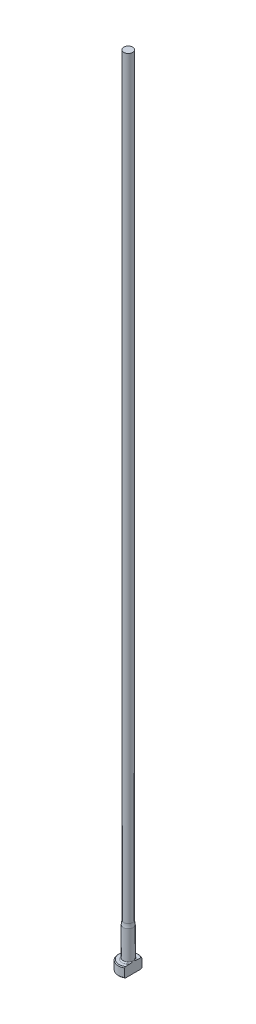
ISO-10303-21;
HEADER;
FILE_DESCRIPTION(('STEP AP214'),'2;1');
FILE_NAME('part.step','',(''),(''),'','','');
FILE_SCHEMA(('AUTOMOTIVE_DESIGN { 1 0 10303 214 1 1 1 1 }'));
ENDSEC;
DATA;
#1=APPLICATION_CONTEXT('core data for automotive mechanical design processes');
#2=APPLICATION_PROTOCOL_DEFINITION('international standard','automotive_design',2000,#1);
#3=PRODUCT_CONTEXT('',#1,'mechanical');
#4=PRODUCT('Part','Part','',(#3));
#5=PRODUCT_RELATED_PRODUCT_CATEGORY('part','',(#4));
#6=PRODUCT_DEFINITION_FORMATION('','',#4);
#7=PRODUCT_DEFINITION_CONTEXT('part definition',#1,'design');
#8=PRODUCT_DEFINITION('design','',#6,#7);
#9=PRODUCT_DEFINITION_SHAPE('','',#8);
#10=(LENGTH_UNIT() NAMED_UNIT(*) SI_UNIT(.MILLI.,.METRE.));
#11=(NAMED_UNIT(*) PLANE_ANGLE_UNIT() SI_UNIT($,.RADIAN.));
#12=(NAMED_UNIT(*) SI_UNIT($,.STERADIAN.) SOLID_ANGLE_UNIT());
#13=UNCERTAINTY_MEASURE_WITH_UNIT(LENGTH_MEASURE(1.E-05),#10,'distance_accuracy_value','');
#14=(GEOMETRIC_REPRESENTATION_CONTEXT(3) GLOBAL_UNCERTAINTY_ASSIGNED_CONTEXT((#13)) GLOBAL_UNIT_ASSIGNED_CONTEXT((#10,
#11,#12)) REPRESENTATION_CONTEXT('',''));
#15=CARTESIAN_POINT('',(0.,0.,0.));
#16=DIRECTION('',(0.,0.,1.));
#17=DIRECTION('',(1.,0.,0.));
#18=AXIS2_PLACEMENT_3D('',#15,#16,#17);
#19=CARTESIAN_POINT('',(-3.17499999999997,3.175,0.));
#20=DIRECTION('',(0.,1.,0.));
#21=DIRECTION('',(0.,0.,1.));
#22=AXIS2_PLACEMENT_3D('',#19,#20,#21);
#23=PLANE('',#22);
#24=CARTESIAN_POINT('',(0.,3.175,0.));
#25=DIRECTION('',(0.,1.,0.));
#26=DIRECTION('',(0.,0.,1.));
#27=AXIS2_PLACEMENT_3D('',#24,#25,#26);
#28=CIRCLE('',#27,2.92099999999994);
#29=CARTESIAN_POINT('',(1.58749999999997,3.175,-2.45195529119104));
#30=VERTEX_POINT('',#29);
#31=CARTESIAN_POINT('',(1.58749999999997,3.175,2.45195529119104));
#32=VERTEX_POINT('',#31);
#33=EDGE_CURVE('E105',#30,#32,#28,.T.);
#34=ORIENTED_EDGE('',*,*,#33,.T.);
#35=DIRECTION('',(0.,0.,1.));
#36=VECTOR('',#35,1.);
#37=CARTESIAN_POINT('',(1.58749999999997,3.17499999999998,2.74963065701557));
#38=LINE('',#37,#36);
#39=CARTESIAN_POINT('',(1.58749999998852,3.175,1.16397422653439));
#40=VERTEX_POINT('',#39);
#41=EDGE_CURVE('E126',#40,#32,#38,.T.);
#42=ORIENTED_EDGE('',*,*,#41,.F.);
#43=CARTESIAN_POINT('',(0.,3.175,0.));
#44=DIRECTION('',(0.,1.,0.));
#45=DIRECTION('',(0.,0.,1.));
#46=AXIS2_PLACEMENT_3D('',#43,#44,#45);
#47=CIRCLE('',#46,1.96849999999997);
#48=CARTESIAN_POINT('',(1.58749999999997,3.175,-1.16397422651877));
#49=VERTEX_POINT('',#48);
#50=EDGE_CURVE('E11',#40,#49,#47,.F.);
#51=ORIENTED_EDGE('',*,*,#50,.T.);
#52=EDGE_CURVE('E52',#30,#49,#38,.T.);
#53=ORIENTED_EDGE('',*,*,#52,.F.);
#54=EDGE_LOOP('',(#34,#42,#51,#53));
#55=FACE_BOUND('',#54,.T.);
#56=ADVANCED_FACE('F32',(#55),#23,.T.);
#57=CARTESIAN_POINT('',(0.,259.958771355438,0.));
#58=DIRECTION('',(0.,1.,0.));
#59=DIRECTION('',(0.,0.,1.));
#60=AXIS2_PLACEMENT_3D('',#57,#58,#59);
#61=CYLINDRICAL_SURFACE('',#60,3.17499999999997);
#62=CARTESIAN_POINT('',(0.,2.92100000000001,0.));
#63=DIRECTION('',(0.,1.,0.));
#64=DIRECTION('',(0.,0.,1.));
#65=AXIS2_PLACEMENT_3D('',#62,#63,#64);
#66=CIRCLE('',#65,3.17499999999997);
#67=CARTESIAN_POINT('',(1.58749999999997,2.92100000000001,2.74963065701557));
#68=VERTEX_POINT('',#67);
#69=CARTESIAN_POINT('',(1.58749999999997,2.92100000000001,-2.74963065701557));
#70=VERTEX_POINT('',#69);
#71=EDGE_CURVE('E98',#68,#70,#66,.F.);
#72=ORIENTED_EDGE('',*,*,#71,.T.);
#73=DIRECTION('',(0.,-1.,0.));
#74=VECTOR('',#73,1.);
#75=CARTESIAN_POINT('',(1.58749999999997,254.001,-2.74963065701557));
#76=LINE('',#75,#74);
#77=CARTESIAN_POINT('',(1.58749999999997,0.253999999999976,-2.74963065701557));
#78=VERTEX_POINT('',#77);
#79=EDGE_CURVE('E141',#70,#78,#76,.T.);
#80=ORIENTED_EDGE('',*,*,#79,.T.);
#81=CARTESIAN_POINT('',(0.,0.253999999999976,0.));
#82=DIRECTION('',(0.,-1.,0.));
#83=DIRECTION('',(0.,0.,-1.));
#84=AXIS2_PLACEMENT_3D('',#81,#82,#83);
#85=CIRCLE('',#84,3.17499999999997);
#86=CARTESIAN_POINT('',(1.58749999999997,0.253999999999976,2.74963065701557));
#87=VERTEX_POINT('',#86);
#88=EDGE_CURVE('E95',#78,#87,#85,.F.);
#89=ORIENTED_EDGE('',*,*,#88,.T.);
#90=DIRECTION('',(0.,-1.,0.));
#91=VECTOR('',#90,1.);
#92=CARTESIAN_POINT('',(1.58749999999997,254.001,2.74963065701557));
#93=LINE('',#92,#91);
#94=EDGE_CURVE('E88',#68,#87,#93,.T.);
#95=ORIENTED_EDGE('',*,*,#94,.F.);
#96=EDGE_LOOP('',(#72,#80,#89,#95));
#97=FACE_BOUND('',#96,.T.);
#98=ADVANCED_FACE('F191',(#97),#61,.T.);
#99=CARTESIAN_POINT('',(0.,0.,0.));
#100=DIRECTION('',(0.,-1.,0.));
#101=DIRECTION('',(0.,0.,-1.));
#102=AXIS2_PLACEMENT_3D('',#99,#100,#101);
#103=PLANE('',#102);
#104=CARTESIAN_POINT('',(0.,0.,0.));
#105=DIRECTION('',(0.,-1.,0.));
#106=DIRECTION('',(0.,0.,-1.));
#107=AXIS2_PLACEMENT_3D('',#104,#105,#106);
#108=CIRCLE('',#107,2.92100000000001);
#109=CARTESIAN_POINT('',(1.58749999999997,0.,2.45195529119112));
#110=VERTEX_POINT('',#109);
#111=CARTESIAN_POINT('',(1.58749999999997,0.,-2.45195529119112));
#112=VERTEX_POINT('',#111);
#113=EDGE_CURVE('E93',#110,#112,#108,.T.);
#114=ORIENTED_EDGE('',*,*,#113,.T.);
#115=DIRECTION('',(0.,0.,1.));
#116=VECTOR('',#115,1.);
#117=CARTESIAN_POINT('',(1.58749999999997,0.,2.74963065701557));
#118=LINE('',#117,#116);
#119=EDGE_CURVE('E78',#112,#110,#118,.T.);
#120=ORIENTED_EDGE('',*,*,#119,.T.);
#121=EDGE_LOOP('',(#114,#120));
#122=FACE_BOUND('',#121,.T.);
#123=ADVANCED_FACE('F97',(#122),#103,.T.);
#124=CARTESIAN_POINT('',(0.,3.17499999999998,0.));
#125=DIRECTION('',(0.,-1.,0.));
#126=DIRECTION('',(0.,0.,-1.));
#127=AXIS2_PLACEMENT_3D('',#124,#125,#126);
#128=CONICAL_SURFACE('',#127,2.92099999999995,0.785398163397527);
#129=ORIENTED_EDGE('',*,*,#71,.F.);
#130=CARTESIAN_POINT('',(1.58749999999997,-0.16162066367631,-6.0529050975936));
#131=CARTESIAN_POINT('',(1.58749999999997,-0.0288893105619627,-5.91567682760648));
#132=CARTESIAN_POINT('',(1.58749999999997,0.103699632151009,-5.7783103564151));
#133=CARTESIAN_POINT('',(1.58749999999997,0.368508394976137,-5.50321874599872));
#134=CARTESIAN_POINT('',(1.58749999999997,0.500728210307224,-5.36549360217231));
#135=CARTESIAN_POINT('',(1.58749999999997,0.764778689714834,-5.08953516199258));
#136=CARTESIAN_POINT('',(1.58749999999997,0.896609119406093,-4.9513016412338));
#137=CARTESIAN_POINT('',(1.58749999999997,1.15968706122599,-4.67428233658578));
#138=CARTESIAN_POINT('',(1.58749999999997,1.29093457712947,-4.53549655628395));
#139=CARTESIAN_POINT('',(1.58749999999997,1.55007705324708,-4.25997724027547));
#140=CARTESIAN_POINT('',(1.58749999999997,1.67798684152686,-4.12325766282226));
#141=CARTESIAN_POINT('',(1.58749999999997,1.9328486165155,-3.84892898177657));
#142=CARTESIAN_POINT('',(1.58749999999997,2.05980060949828,-3.71131988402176));
#143=CARTESIAN_POINT('',(1.58749999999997,2.31237508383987,-3.43493978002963));
#144=CARTESIAN_POINT('',(1.58749999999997,2.43799784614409,-3.29616903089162));
#145=CARTESIAN_POINT('',(1.58749999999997,2.68741369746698,-3.01699558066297));
#146=CARTESIAN_POINT('',(1.58749999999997,2.81120686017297,-2.8765929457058));
#147=CARTESIAN_POINT('',(1.58749999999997,3.00875865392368,-2.64816703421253));
#148=CARTESIAN_POINT('',(1.58749999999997,3.08336151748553,-2.56087478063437));
#149=CARTESIAN_POINT('',(1.58749999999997,3.2312387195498,-2.38515423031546));
#150=CARTESIAN_POINT('',(1.58749999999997,3.30451292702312,-2.29672582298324));
#151=CARTESIAN_POINT('',(1.58749999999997,3.45004422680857,-2.1174740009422));
#152=CARTESIAN_POINT('',(1.58749999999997,3.5222823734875,-2.02663514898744));
#153=CARTESIAN_POINT('',(1.58749999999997,3.66423097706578,-1.8430252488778));
#154=CARTESIAN_POINT('',(1.58749999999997,3.73394203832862,-1.75025467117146));
#155=CARTESIAN_POINT('',(1.58749999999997,3.87080633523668,-1.5606747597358));
#156=CARTESIAN_POINT('',(1.58749999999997,3.93790459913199,-1.46382547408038));
#157=CARTESIAN_POINT('',(1.58749999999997,4.06669147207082,-1.26632594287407));
#158=CARTESIAN_POINT('',(1.58749999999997,4.1283726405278,-1.16567073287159));
#159=CARTESIAN_POINT('',(1.58749999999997,4.21402252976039,-1.01165766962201));
#160=CARTESIAN_POINT('',(1.58749999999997,4.24127929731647,-0.960142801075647));
#161=CARTESIAN_POINT('',(1.58749999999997,4.2930979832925,-0.855780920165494));
#162=CARTESIAN_POINT('',(1.58749999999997,4.31765941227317,-0.802933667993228));
#163=CARTESIAN_POINT('',(1.58749999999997,4.38614656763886,-0.642461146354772));
#164=CARTESIAN_POINT('',(1.58749999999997,4.42510149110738,-0.532518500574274));
#165=CARTESIAN_POINT('',(1.58749999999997,4.46726244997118,-0.367680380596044));
#166=CARTESIAN_POINT('',(1.58749999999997,4.47844427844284,-0.314802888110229));
#167=CARTESIAN_POINT('',(1.58749999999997,4.49576654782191,-0.208209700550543));
#168=CARTESIAN_POINT('',(1.58749999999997,4.50190743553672,-0.154494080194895));
#169=CARTESIAN_POINT('',(1.58749999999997,4.50871296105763,-0.0468792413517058));
#170=CARTESIAN_POINT('',(1.58749999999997,4.5093945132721,0.00701889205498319));
#171=CARTESIAN_POINT('',(1.58749999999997,4.50527679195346,0.114606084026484));
#172=CARTESIAN_POINT('',(1.58749999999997,4.50047706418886,0.168295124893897));
#173=CARTESIAN_POINT('',(1.58749999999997,4.48579689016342,0.27448544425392));
#174=CARTESIAN_POINT('',(1.58749999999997,4.47596081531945,0.32699298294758));
#175=CARTESIAN_POINT('',(1.58749999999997,4.45181809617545,0.430974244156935));
#176=CARTESIAN_POINT('',(1.58749999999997,4.4375096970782,0.482447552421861));
#177=CARTESIAN_POINT('',(1.58749999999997,4.40502489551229,0.584460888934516));
#178=CARTESIAN_POINT('',(1.58749999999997,4.386827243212,0.634994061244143));
#179=CARTESIAN_POINT('',(1.58749999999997,4.34729308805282,0.734789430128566));
#180=CARTESIAN_POINT('',(1.58749999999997,4.3259572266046,0.784051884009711));
#181=CARTESIAN_POINT('',(1.58749999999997,4.25791922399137,0.930549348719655));
#182=CARTESIAN_POINT('',(1.58749999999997,4.20736047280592,1.0259880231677));
#183=CARTESIAN_POINT('',(1.58749999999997,4.0995545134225,1.21304313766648));
#184=CARTESIAN_POINT('',(1.58749999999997,4.04229912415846,1.30465471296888));
#185=CARTESIAN_POINT('',(1.58749999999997,3.92308746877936,1.48526211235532));
#186=CARTESIAN_POINT('',(1.58749999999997,3.86111349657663,1.57424615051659));
#187=CARTESIAN_POINT('',(1.58749999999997,3.73408621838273,1.74990003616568));
#188=CARTESIAN_POINT('',(1.58749999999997,3.66903444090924,1.83657099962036));
#189=CARTESIAN_POINT('',(1.58749999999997,3.53583371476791,2.00931764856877));
#190=CARTESIAN_POINT('',(1.58749999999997,3.46765527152,2.09537048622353));
#191=CARTESIAN_POINT('',(1.58749999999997,3.32960643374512,2.26611736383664));
#192=CARTESIAN_POINT('',(1.58749999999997,3.25973586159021,2.35081125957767));
#193=CARTESIAN_POINT('',(1.58749999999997,3.04858139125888,2.60290121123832));
#194=CARTESIAN_POINT('',(1.58749999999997,2.90542388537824,2.76872537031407));
#195=CARTESIAN_POINT('',(1.58749999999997,2.64069522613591,3.06970913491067));
#196=CARTESIAN_POINT('',(1.58749999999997,2.51959458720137,3.20528660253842));
#197=CARTESIAN_POINT('',(1.58749999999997,2.27590400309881,3.47510321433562));
#198=CARTESIAN_POINT('',(1.58749999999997,2.15331401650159,3.60934232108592));
#199=CARTESIAN_POINT('',(1.58749999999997,1.90694239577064,3.87695374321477));
#200=CARTESIAN_POINT('',(1.58749999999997,1.78315974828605,4.0103251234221));
#201=CARTESIAN_POINT('',(1.58749999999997,1.53478104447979,4.27630880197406));
#202=CARTESIAN_POINT('',(1.58749999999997,1.41018498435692,4.40892109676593));
#203=CARTESIAN_POINT('',(1.58749999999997,1.0457468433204,4.79499418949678));
#204=CARTESIAN_POINT('',(1.58749999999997,0.80507680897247,5.04767313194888));
#205=CARTESIAN_POINT('',(1.58749999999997,0.443121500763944,5.42550911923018));
#206=CARTESIAN_POINT('',(1.58749999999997,0.322378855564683,5.55118772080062));
#207=CARTESIAN_POINT('',(1.58749999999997,0.0805914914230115,5.80225207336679));
#208=CARTESIAN_POINT('',(1.58749999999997,-0.040453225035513,5.92763782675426));
#209=CARTESIAN_POINT('',(1.58749999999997,-0.161620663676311,6.0529050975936));
#210=B_SPLINE_CURVE_WITH_KNOTS('',3,(#130,#131,#132,#133,#134,#135,#136,#137,#138,#139,#140,
#141,#142,#143,#144,#145,#146,#147,#148,#149,#150,#151,#152,#153,#154,#155,#156,#157,#158,#159,
#160,#161,#162,#163,#164,#165,#166,#167,#168,#169,#170,#171,#172,#173,#174,#175,#176,#177,#178,
#179,#180,#181,#182,#183,#184,#185,#186,#187,#188,#189,#190,#191,#192,#193,#194,#195,#196,#197,
#198,#199,#200,#201,#202,#203,#204,#205,#206,#207,#208,#209),.UNSPECIFIED.,.F.,.F.,(4,2,2,2,2,2,
2,2,2,2,2,2,2,2,2,2,2,2,2,2,2,2,2,2,2,2,2,2,2,2,2,2,2,2,2,2,2,2,2,4),(0.,0.572750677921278,
1.14550874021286,1.71856057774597,2.29160869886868,2.85328006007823,3.4149477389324,
3.97649423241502,4.53801804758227,4.88249307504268,5.22700189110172,5.5751532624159,
5.92322081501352,6.27657800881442,6.63041319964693,6.80518126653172,6.9799810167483,
7.3282426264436,7.49018491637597,7.65211285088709,7.81353889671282,7.97497832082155,
8.13501929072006,8.29512313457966,8.45612518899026,8.61709438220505,8.94062993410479,
9.2645649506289,9.58978187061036,9.91483894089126,10.2441741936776,10.5735441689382,
11.2306812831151,11.7760337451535,12.3214014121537,12.8672825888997,13.4131663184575,
14.4600164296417,14.9828595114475,15.5056983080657),.UNSPECIFIED.);
#211=EDGE_CURVE('E118',#32,#68,#210,.T.);
#212=ORIENTED_EDGE('',*,*,#211,.F.);
#213=ORIENTED_EDGE('',*,*,#33,.F.);
#214=EDGE_CURVE('E117',#70,#30,#210,.T.);
#215=ORIENTED_EDGE('',*,*,#214,.F.);
#216=EDGE_LOOP('',(#129,#212,#213,#215));
#217=FACE_BOUND('',#216,.T.);
#218=ADVANCED_FACE('F162',(#217),#128,.T.);
#219=CARTESIAN_POINT('',(0.,0.253999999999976,0.));
#220=DIRECTION('',(0.,1.,0.));
#221=DIRECTION('',(0.,0.,1.));
#222=AXIS2_PLACEMENT_3D('',#219,#220,#221);
#223=CONICAL_SURFACE('',#222,3.17499999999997,0.785398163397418);
#224=ORIENTED_EDGE('',*,*,#88,.F.);
#225=CARTESIAN_POINT('',(1.58749999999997,3.33662066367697,6.0529050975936));
#226=CARTESIAN_POINT('',(1.58749999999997,3.20388931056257,5.91567682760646));
#227=CARTESIAN_POINT('',(1.58749999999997,3.07130036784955,5.77831035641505));
#228=CARTESIAN_POINT('',(1.58749999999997,2.80649160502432,5.50321874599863));
#229=CARTESIAN_POINT('',(1.58749999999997,2.67427178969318,5.3654936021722));
#230=CARTESIAN_POINT('',(1.58749999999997,2.41022131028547,5.08953516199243));
#231=CARTESIAN_POINT('',(1.58749999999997,2.27839088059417,4.95130164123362));
#232=CARTESIAN_POINT('',(1.58749999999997,2.01531293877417,4.67428233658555));
#233=CARTESIAN_POINT('',(1.58749999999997,1.88406542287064,4.5354965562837));
#234=CARTESIAN_POINT('',(1.58749999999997,1.62492294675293,4.25997724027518));
#235=CARTESIAN_POINT('',(1.58749999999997,1.49701315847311,4.12325766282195));
#236=CARTESIAN_POINT('',(1.58749999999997,1.24215138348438,3.84892898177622));
#237=CARTESIAN_POINT('',(1.58749999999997,1.11519939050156,3.71131988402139));
#238=CARTESIAN_POINT('',(1.58749999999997,0.862624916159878,3.43493978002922));
#239=CARTESIAN_POINT('',(1.58749999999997,0.737002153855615,3.29616903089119));
#240=CARTESIAN_POINT('',(1.58749999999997,0.487586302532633,3.01699558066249));
#241=CARTESIAN_POINT('',(1.58749999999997,0.363793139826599,2.8765929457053));
#242=CARTESIAN_POINT('',(1.58749999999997,0.166241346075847,2.64816703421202));
#243=CARTESIAN_POINT('',(1.58749999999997,0.0916384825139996,2.56087478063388));
#244=CARTESIAN_POINT('',(1.58749999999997,-0.0562387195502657,2.385154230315));
#245=CARTESIAN_POINT('',(1.58749999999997,-0.129512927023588,2.29672582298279));
#246=CARTESIAN_POINT('',(1.58749999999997,-0.27504422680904,2.11747400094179));
#247=CARTESIAN_POINT('',(1.58749999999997,-0.347282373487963,2.02663514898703));
#248=CARTESIAN_POINT('',(1.58749999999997,-0.489230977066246,1.84302524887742));
#249=CARTESIAN_POINT('',(1.58749999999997,-0.558942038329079,1.7502546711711));
#250=CARTESIAN_POINT('',(1.58749999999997,-0.695806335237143,1.56067475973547));
#251=CARTESIAN_POINT('',(1.58749999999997,-0.762904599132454,1.46382547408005));
#252=CARTESIAN_POINT('',(1.58749999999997,-0.891691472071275,1.26632594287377));
#253=CARTESIAN_POINT('',(1.58749999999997,-0.953372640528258,1.16567073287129));
#254=CARTESIAN_POINT('',(1.58749999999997,-1.03902252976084,1.01165766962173));
#255=CARTESIAN_POINT('',(1.58749999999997,-1.06627929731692,0.960142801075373));
#256=CARTESIAN_POINT('',(1.58749999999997,-1.11809798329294,0.85578092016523));
#257=CARTESIAN_POINT('',(1.58749999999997,-1.14265941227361,0.802933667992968));
#258=CARTESIAN_POINT('',(1.58749999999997,-1.21114656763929,0.642461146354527));
#259=CARTESIAN_POINT('',(1.58749999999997,-1.2501014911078,0.532518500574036));
#260=CARTESIAN_POINT('',(1.58749999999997,-1.29226244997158,0.367680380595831));
#261=CARTESIAN_POINT('',(1.58749999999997,-1.30344427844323,0.314802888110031));
#262=CARTESIAN_POINT('',(1.58749999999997,-1.32076654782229,0.208209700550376));
#263=CARTESIAN_POINT('',(1.58749999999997,-1.3269074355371,0.154494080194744));
#264=CARTESIAN_POINT('',(1.58749999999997,-1.333712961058,0.0468792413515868));
#265=CARTESIAN_POINT('',(1.58749999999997,-1.33439451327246,-0.00701889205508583));
#266=CARTESIAN_POINT('',(1.58749999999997,-1.33027679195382,-0.114606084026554));
#267=CARTESIAN_POINT('',(1.58749999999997,-1.32547706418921,-0.168295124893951));
#268=CARTESIAN_POINT('',(1.58749999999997,-1.31079689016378,-0.274485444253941));
#269=CARTESIAN_POINT('',(1.58749999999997,-1.3009608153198,-0.326992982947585));
#270=CARTESIAN_POINT('',(1.58749999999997,-1.27681809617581,-0.430974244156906));
#271=CARTESIAN_POINT('',(1.58749999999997,-1.26250969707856,-0.482447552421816));
#272=CARTESIAN_POINT('',(1.58749999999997,-1.23002489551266,-0.584460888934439));
#273=CARTESIAN_POINT('',(1.58749999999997,-1.21182724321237,-0.634994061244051));
#274=CARTESIAN_POINT('',(1.58749999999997,-1.1722930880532,-0.734789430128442));
#275=CARTESIAN_POINT('',(1.58749999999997,-1.15095722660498,-0.784051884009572));
#276=CARTESIAN_POINT('',(1.58749999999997,-1.08291922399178,-0.93054934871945));
#277=CARTESIAN_POINT('',(1.58749999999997,-1.03236047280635,-1.02598802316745));
#278=CARTESIAN_POINT('',(1.58749999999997,-0.924554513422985,-1.21304313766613));
#279=CARTESIAN_POINT('',(1.58749999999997,-0.86729912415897,-1.30465471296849));
#280=CARTESIAN_POINT('',(1.58749999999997,-0.748087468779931,-1.48526211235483));
#281=CARTESIAN_POINT('',(1.58749999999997,-0.686113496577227,-1.57424615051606));
#282=CARTESIAN_POINT('',(1.58749999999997,-0.55908621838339,-1.74990003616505));
#283=CARTESIAN_POINT('',(1.58749999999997,-0.494034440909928,-1.83657099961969));
#284=CARTESIAN_POINT('',(1.58749999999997,-0.360833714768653,-2.00931764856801));
#285=CARTESIAN_POINT('',(1.58749999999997,-0.292655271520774,-2.09537048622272));
#286=CARTESIAN_POINT('',(1.58749999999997,-0.154606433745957,-2.26611736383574));
#287=CARTESIAN_POINT('',(1.58749999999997,-0.0847358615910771,-2.35081125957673));
#288=CARTESIAN_POINT('',(1.58749999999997,0.126418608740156,-2.60290121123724));
#289=CARTESIAN_POINT('',(1.58749999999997,0.269576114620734,-2.76872537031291));
#290=CARTESIAN_POINT('',(1.58749999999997,0.534304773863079,-3.06970913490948));
#291=CARTESIAN_POINT('',(1.58749999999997,0.655405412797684,-3.20528660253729));
#292=CARTESIAN_POINT('',(1.58749999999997,0.899095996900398,-3.47510321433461));
#293=CARTESIAN_POINT('',(1.58749999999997,1.02168598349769,-3.60934232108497));
#294=CARTESIAN_POINT('',(1.58749999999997,1.26805760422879,-3.87695374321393));
#295=CARTESIAN_POINT('',(1.58749999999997,1.39184025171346,-4.01032512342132));
#296=CARTESIAN_POINT('',(1.58749999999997,1.64021895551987,-4.2763088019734));
#297=CARTESIAN_POINT('',(1.58749999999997,1.76481501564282,-4.40892109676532));
#298=CARTESIAN_POINT('',(1.58749999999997,2.12925315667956,-4.79499418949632));
#299=CARTESIAN_POINT('',(1.58749999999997,2.36992319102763,-5.04767313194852));
#300=CARTESIAN_POINT('',(1.58749999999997,2.73187849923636,-5.42550911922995));
#301=CARTESIAN_POINT('',(1.58749999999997,2.85262114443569,-5.55118772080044));
#302=CARTESIAN_POINT('',(1.58749999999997,3.09440850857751,-5.8022520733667));
#303=CARTESIAN_POINT('',(1.58749999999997,3.2154532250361,-5.92763782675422));
#304=CARTESIAN_POINT('',(1.58749999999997,3.33662066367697,-6.0529050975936));
#305=B_SPLINE_CURVE_WITH_KNOTS('',3,(#225,#226,#227,#228,#229,#230,#231,#232,#233,#234,#235,
#236,#237,#238,#239,#240,#241,#242,#243,#244,#245,#246,#247,#248,#249,#250,#251,#252,#253,#254,
#255,#256,#257,#258,#259,#260,#261,#262,#263,#264,#265,#266,#267,#268,#269,#270,#271,#272,#273,
#274,#275,#276,#277,#278,#279,#280,#281,#282,#283,#284,#285,#286,#287,#288,#289,#290,#291,#292,
#293,#294,#295,#296,#297,#298,#299,#300,#301,#302,#303,#304),.UNSPECIFIED.,.F.,.F.,(4,2,2,2,2,2,
2,2,2,2,2,2,2,2,2,2,2,2,2,2,2,2,2,2,2,2,2,2,2,2,2,2,2,2,2,2,2,2,2,4),(0.,0.57275067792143,
1.14550874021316,1.71856057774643,2.29160869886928,2.85328006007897,3.41494773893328,
3.97649423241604,4.53801804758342,4.88249307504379,5.2270018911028,5.57515326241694,
5.92322081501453,6.27657800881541,6.63041319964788,6.80518126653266,6.97998101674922,
7.32824262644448,7.49018491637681,7.65211285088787,7.81353889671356,7.97497832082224,
8.1350192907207,8.29512313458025,8.45612518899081,8.61709438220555,8.94062993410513,
9.26456495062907,9.58978187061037,9.91483894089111,10.2441741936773,10.5735441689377,
11.2306812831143,11.776033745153,12.3214014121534,12.8672825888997,13.4131663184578,
14.4600164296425,14.9828595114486,15.505698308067),.UNSPECIFIED.);
#306=EDGE_CURVE('E81',#112,#78,#305,.T.);
#307=ORIENTED_EDGE('',*,*,#306,.F.);
#308=ORIENTED_EDGE('',*,*,#113,.F.);
#309=EDGE_CURVE('E84',#87,#110,#305,.T.);
#310=ORIENTED_EDGE('',*,*,#309,.F.);
#311=EDGE_LOOP('',(#224,#307,#308,#310));
#312=FACE_BOUND('',#311,.T.);
#313=ADVANCED_FACE('F92',(#312),#223,.T.);
#314=CARTESIAN_POINT('',(0.,3.556,0.));
#315=DIRECTION('',(0.,1.,0.));
#316=DIRECTION('',(0.,0.,1.));
#317=AXIS2_PLACEMENT_3D('',#314,#315,#316);
#318=TOROIDAL_SURFACE('',#317,1.96849999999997,0.381);
#319=CARTESIAN_POINT('',(1.58749999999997,3.556,0.));
#320=CARTESIAN_POINT('',(1.58749999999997,3.55599928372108,-9.72839998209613E-12));
#321=CARTESIAN_POINT('',(1.58749999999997,3.55599856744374,-1.16390048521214E-07));
#322=CARTESIAN_POINT('',(1.58749999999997,3.55599717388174,-5.02802253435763E-07));
#323=CARTESIAN_POINT('',(1.58749999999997,3.55599649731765,-7.75049116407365E-07));
#324=CARTESIAN_POINT('',(1.58749999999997,3.55599515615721,-1.43578185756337E-06));
#325=CARTESIAN_POINT('',(1.58749999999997,3.55599449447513,-1.83004116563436E-06));
#326=CARTESIAN_POINT('',(1.58749999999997,3.55599322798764,-2.69326525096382E-06));
#327=CARTESIAN_POINT('',(1.58749999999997,3.55599262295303,-3.16190628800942E-06));
#328=CARTESIAN_POINT('',(1.58749999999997,3.55599066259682,-4.80183833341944E-06));
#329=CARTESIAN_POINT('',(1.58749999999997,3.55598938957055,-6.07237548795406E-06));
#330=CARTESIAN_POINT('',(1.58749999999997,3.55598706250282,-8.74131694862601E-06));
#331=CARTESIAN_POINT('',(1.58749999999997,3.55598600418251,-1.01362054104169E-05));
#332=CARTESIAN_POINT('',(1.58749999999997,3.55598220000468,-1.54025644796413E-05));
#333=CARTESIAN_POINT('',(1.58749999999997,3.55597966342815,-1.94297992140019E-05));
#334=CARTESIAN_POINT('',(1.58749999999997,3.55597535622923,-2.75116574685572E-05));
#335=CARTESIAN_POINT('',(1.58749999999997,3.55597354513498,-3.15456374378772E-05));
#336=CARTESIAN_POINT('',(1.58749999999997,3.55596616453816,-4.82039076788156E-05));
#337=CARTESIAN_POINT('',(1.58749999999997,3.55596077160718,-6.08993138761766E-05));
#338=CARTESIAN_POINT('',(1.58749999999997,3.55595181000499,-8.49758225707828E-05));
#339=CARTESIAN_POINT('',(1.58749999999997,3.55594809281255,-9.6299831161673E-05));
#340=CARTESIAN_POINT('',(1.58749999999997,3.55591954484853,-0.000176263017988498));
#341=CARTESIAN_POINT('',(1.58749999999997,3.55588430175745,-0.000240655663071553));
#342=CARTESIAN_POINT('',(1.58749999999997,3.55575419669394,-0.000487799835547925));
#343=CARTESIAN_POINT('',(1.58749999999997,3.55566706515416,-0.000673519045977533));
#344=CARTESIAN_POINT('',(1.58749999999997,3.55532896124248,-0.00138308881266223));
#345=CARTESIAN_POINT('',(1.58749999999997,3.55506990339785,-0.0019038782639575));
#346=CARTESIAN_POINT('',(1.58749999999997,3.55403272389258,-0.00399959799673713));
#347=CARTESIAN_POINT('',(1.58749999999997,3.55326363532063,-0.0055779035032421));
#348=CARTESIAN_POINT('',(1.58749999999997,3.53734419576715,-0.0382341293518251));
#349=CARTESIAN_POINT('',(1.58749999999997,3.52209124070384,-0.0692744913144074));
#350=CARTESIAN_POINT('',(1.58749999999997,3.49234031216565,-0.130397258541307));
#351=CARTESIAN_POINT('',(1.58749999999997,3.4778343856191,-0.160476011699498));
#352=CARTESIAN_POINT('',(1.58749999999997,3.44756579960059,-0.22405302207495));
#353=CARTESIAN_POINT('',(1.58749999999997,3.43183768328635,-0.257567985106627));
#354=CARTESIAN_POINT('',(1.58749999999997,3.40084315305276,-0.325196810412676));
#355=CARTESIAN_POINT('',(1.58749999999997,3.38558252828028,-0.359313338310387));
#356=CARTESIAN_POINT('',(1.58749999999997,3.35947844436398,-0.419670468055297));
#357=CARTESIAN_POINT('',(1.58749999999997,3.34845502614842,-0.445832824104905));
#358=CARTESIAN_POINT('',(1.58749999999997,3.32703860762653,-0.498343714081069));
#359=CARTESIAN_POINT('',(1.58749999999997,3.31664422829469,-0.52469168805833));
#360=CARTESIAN_POINT('',(1.58749999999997,3.2869407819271,-0.603098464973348));
#361=CARTESIAN_POINT('',(1.58749999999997,3.26865317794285,-0.655557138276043));
#362=CARTESIAN_POINT('',(1.58749999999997,3.24332469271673,-0.737608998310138));
#363=CARTESIAN_POINT('',(1.58749999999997,3.23494346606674,-0.766787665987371));
#364=CARTESIAN_POINT('',(1.58749999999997,3.21949479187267,-0.825628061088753));
#365=CARTESIAN_POINT('',(1.58749999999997,3.21243348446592,-0.855291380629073));
#366=CARTESIAN_POINT('',(1.58749999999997,3.19303275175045,-0.947623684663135));
#367=CARTESIAN_POINT('',(1.58749999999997,3.18336484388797,-1.01091582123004));
#368=CARTESIAN_POINT('',(1.58749999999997,3.17464826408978,-1.12491727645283));
#369=CARTESIAN_POINT('',(1.58749999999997,3.17379742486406,-1.17548103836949));
#370=CARTESIAN_POINT('',(1.58749999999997,3.17980825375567,-1.2756075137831));
#371=CARTESIAN_POINT('',(1.58749999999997,3.18656467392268,-1.32517446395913));
#372=CARTESIAN_POINT('',(1.58749999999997,3.20510062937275,-1.40268723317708));
#373=CARTESIAN_POINT('',(1.58749999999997,3.21379930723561,-1.43136704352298));
#374=CARTESIAN_POINT('',(1.58749999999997,3.23523847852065,-1.48727388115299));
#375=CARTESIAN_POINT('',(1.58749999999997,3.24798385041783,-1.51449910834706));
#376=CARTESIAN_POINT('',(1.58749999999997,3.27479889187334,-1.56082978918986));
#377=CARTESIAN_POINT('',(1.58749999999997,3.2880084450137,-1.5804296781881));
#378=CARTESIAN_POINT('',(1.58749999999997,3.31738741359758,-1.61726850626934));
#379=CARTESIAN_POINT('',(1.58749999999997,3.33355126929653,-1.63451177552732));
#380=CARTESIAN_POINT('',(1.58749999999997,3.3650209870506,-1.66235366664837));
#381=CARTESIAN_POINT('',(1.58749999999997,3.37976591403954,-1.67358404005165));
#382=CARTESIAN_POINT('',(1.58749999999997,3.41090649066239,-1.69348690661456));
#383=CARTESIAN_POINT('',(1.58749999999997,3.42730148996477,-1.70216040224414));
#384=CARTESIAN_POINT('',(1.58749999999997,3.46152587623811,-1.71647536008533));
#385=CARTESIAN_POINT('',(1.58749999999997,3.47936500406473,-1.72209384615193));
#386=CARTESIAN_POINT('',(1.58749999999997,3.51579449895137,-1.72977101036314));
#387=CARTESIAN_POINT('',(1.58749999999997,3.53438431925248,-1.73183223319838));
#388=CARTESIAN_POINT('',(1.58749999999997,3.5693049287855,-1.73220894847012));
#389=CARTESIAN_POINT('',(1.58749999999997,3.58563247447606,-1.73095378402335));
#390=CARTESIAN_POINT('',(1.58749999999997,3.61782719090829,-1.72566824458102));
#391=CARTESIAN_POINT('',(1.58749999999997,3.6336944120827,-1.72163817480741));
#392=CARTESIAN_POINT('',(1.58749999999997,3.66430913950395,-1.71112762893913));
#393=CARTESIAN_POINT('',(1.58749999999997,3.67907021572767,-1.70468621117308));
#394=CARTESIAN_POINT('',(1.58749999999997,3.7074589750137,-1.68967506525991));
#395=CARTESIAN_POINT('',(1.58749999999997,3.72108625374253,-1.68110458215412));
#396=CARTESIAN_POINT('',(1.58749999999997,3.75190835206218,-1.6586320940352));
#397=CARTESIAN_POINT('',(1.58749999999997,3.76852524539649,-1.64393589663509));
#398=CARTESIAN_POINT('',(1.58749999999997,3.79915076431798,-1.61203006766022));
#399=CARTESIAN_POINT('',(1.58749999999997,3.81315342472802,-1.59481484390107));
#400=CARTESIAN_POINT('',(1.58749999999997,3.84335302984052,-1.55180967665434));
#401=CARTESIAN_POINT('',(1.58749999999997,3.85840997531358,-1.52522183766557));
#402=CARTESIAN_POINT('',(1.58749999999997,3.8840928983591,-1.47008223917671));
#403=CARTESIAN_POINT('',(1.58749999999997,3.89472145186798,-1.44153163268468));
#404=CARTESIAN_POINT('',(1.58749999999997,3.91656912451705,-1.36850699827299));
#405=CARTESIAN_POINT('',(1.58749999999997,3.92534811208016,-1.32330828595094));
#406=CARTESIAN_POINT('',(1.58749999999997,3.93598980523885,-1.23163561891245));
#407=CARTESIAN_POINT('',(1.58749999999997,3.93776012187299,-1.18515271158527));
#408=CARTESIAN_POINT('',(1.58749999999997,3.93485724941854,-1.056626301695));
#409=CARTESIAN_POINT('',(1.58749999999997,3.9241811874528,-0.974728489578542));
#410=CARTESIAN_POINT('',(1.58749999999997,3.899893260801,-0.855941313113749));
#411=CARTESIAN_POINT('',(1.58749999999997,3.89075037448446,-0.817952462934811));
#412=CARTESIAN_POINT('',(1.58749999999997,3.87034922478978,-0.742758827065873));
#413=CARTESIAN_POINT('',(1.58749999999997,3.85910312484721,-0.705550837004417));
#414=CARTESIAN_POINT('',(1.58749999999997,3.83067738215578,-0.618900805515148));
#415=CARTESIAN_POINT('',(1.58749999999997,3.81279292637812,-0.56969368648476));
#416=CARTESIAN_POINT('',(1.58749999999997,3.78404415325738,-0.496059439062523));
#417=CARTESIAN_POINT('',(1.58749999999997,3.77402894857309,-0.471293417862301));
#418=CARTESIAN_POINT('',(1.58749999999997,3.75347166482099,-0.421913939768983));
#419=CARTESIAN_POINT('',(1.58749999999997,3.74292842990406,-0.39730096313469));
#420=CARTESIAN_POINT('',(1.58749999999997,3.71797467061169,-0.340371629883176));
#421=CARTESIAN_POINT('',(1.58749999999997,3.7034106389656,-0.308122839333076));
#422=CARTESIAN_POINT('',(1.58749999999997,3.67389634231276,-0.244169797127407));
#423=CARTESIAN_POINT('',(1.58749999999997,3.65895097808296,-0.212463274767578));
#424=CARTESIAN_POINT('',(1.58749999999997,3.63022587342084,-0.152300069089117));
#425=CARTESIAN_POINT('',(1.58749999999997,3.61647532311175,-0.123829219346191));
#426=CARTESIAN_POINT('',(1.58749999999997,3.58829058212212,-0.065967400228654));
#427=CARTESIAN_POINT('',(1.58749999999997,3.57384944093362,-0.036579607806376));
#428=CARTESIAN_POINT('',(1.58749999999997,3.55873641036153,-0.00557801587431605));
#429=CARTESIAN_POINT('',(1.58749999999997,3.557967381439,-0.00399981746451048));
#430=CARTESIAN_POINT('',(1.58749999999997,3.55693021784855,-0.00190412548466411));
#431=CARTESIAN_POINT('',(1.58749999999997,3.55667111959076,-0.00138325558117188));
#432=CARTESIAN_POINT('',(1.58749999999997,3.55633296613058,-0.00067358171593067));
#433=CARTESIAN_POINT('',(1.58749999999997,3.55624582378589,-0.000487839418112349));
#434=CARTESIAN_POINT('',(1.58749999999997,3.55611570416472,-0.000240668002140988));
#435=CARTESIAN_POINT('',(1.58749999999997,3.55608045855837,-0.000176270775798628));
#436=CARTESIAN_POINT('',(1.58749999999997,3.55605190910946,-9.63021903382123E-05));
#437=CARTESIAN_POINT('',(1.58749999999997,3.55604819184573,-8.49777827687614E-05));
#438=CARTESIAN_POINT('',(1.58749999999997,3.55603922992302,-6.09004217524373E-05));
#439=CARTESIAN_POINT('',(1.58749999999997,3.55603383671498,-4.82045726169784E-05));
#440=CARTESIAN_POINT('',(1.58749999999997,3.55602645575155,-3.15458034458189E-05));
#441=CARTESIAN_POINT('',(1.58749999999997,3.55602464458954,-2.75117552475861E-05));
#442=CARTESIAN_POINT('',(1.58749999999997,3.55602033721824,-1.94297725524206E-05));
#443=CARTESIAN_POINT('',(1.58749999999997,3.55601780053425,-1.54024835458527E-05));
#444=CARTESIAN_POINT('',(1.58749999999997,3.55601399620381,-1.01360754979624E-05));
#445=CARTESIAN_POINT('',(1.58749999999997,3.55601293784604,-8.7411813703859E-06));
#446=CARTESIAN_POINT('',(1.58749999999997,3.55601061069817,-6.07223627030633E-06));
#447=CARTESIAN_POINT('',(1.58749999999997,3.55600933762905,-4.80170138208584E-06));
#448=CARTESIAN_POINT('',(1.58749999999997,3.55600737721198,-3.16178168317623E-06));
#449=CARTESIAN_POINT('',(1.58749999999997,3.55600677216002,-2.69314602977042E-06));
#450=CARTESIAN_POINT('',(1.58749999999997,3.55600550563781,-1.82993577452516E-06));
#451=CARTESIAN_POINT('',(1.58749999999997,3.55600484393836,-1.43568493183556E-06));
#452=CARTESIAN_POINT('',(1.58749999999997,3.55600350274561,-7.74972790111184E-07));
#453=CARTESIAN_POINT('',(1.58749999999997,3.55600282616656,-5.02737772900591E-07));
#454=CARTESIAN_POINT('',(1.58749999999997,3.55600143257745,-1.16354060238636E-07));
#455=CARTESIAN_POINT('',(1.58749999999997,3.55600071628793,9.72852226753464E-12));
#456=CARTESIAN_POINT('',(1.58749999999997,3.556,0.));
#457=B_SPLINE_CURVE_WITH_KNOTS('',3,(#319,#320,#321,#322,#323,#324,#325,#326,#327,#328,#329,
#330,#331,#332,#333,#334,#335,#336,#337,#338,#339,#340,#341,#342,#343,#344,#345,#346,#347,#348,
#349,#350,#351,#352,#353,#354,#355,#356,#357,#358,#359,#360,#361,#362,#363,#364,#365,#366,#367,
#368,#369,#370,#371,#372,#373,#374,#375,#376,#377,#378,#379,#380,#381,#382,#383,#384,#385,#386,
#387,#388,#389,#390,#391,#392,#393,#394,#395,#396,#397,#398,#399,#400,#401,#402,#403,#404,#405,
#406,#407,#408,#409,#410,#411,#412,#413,#414,#415,#416,#417,#418,#419,#420,#421,#422,#423,#424,
#425,#426,#427,#428,#429,#430,#431,#432,#433,#434,#435,#436,#437,#438,#439,#440,#441,#442,#443,
#444,#445,#446,#447,#448,#449,#450,#451,#452,#453,#454,#455,#456),.UNSPECIFIED.,.T.,.F.,(4,2,2,
2,2,2,2,2,2,2,2,2,2,2,2,2,2,2,2,2,2,2,2,2,2,2,2,2,2,2,2,2,2,2,2,2,2,2,2,2,2,2,2,2,2,2,2,2,2,2,2,
2,2,2,2,2,2,2,2,2,2,2,2,2,2,2,2,2,4),(0.,2.14653634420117E-06,4.3243617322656E-06,
6.62715069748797E-06,8.92017875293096E-06,1.42892293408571E-05,1.95376032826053E-05,
3.37616071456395E-05,4.70144492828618E-05,8.83789092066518E-05,0.000124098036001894,
0.000343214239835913,0.000959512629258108,0.00270343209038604,0.00797166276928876,
0.11171345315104,0.21189766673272,0.322958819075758,0.435072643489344,0.520234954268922,
0.605203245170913,0.771741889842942,0.862787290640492,0.954246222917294,1.14571222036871,
1.29701464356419,1.44624921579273,1.53592478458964,1.62570887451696,1.69637166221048,
1.76690281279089,1.82229027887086,1.87765600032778,1.93343255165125,1.98916918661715,
2.03805361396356,2.08693266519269,2.13505202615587,2.18318847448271,2.24937187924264,
2.31570450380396,2.4068617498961,2.49796589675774,2.63532677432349,2.77449244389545,
3.02069049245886,3.13789423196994,3.25444001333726,3.41142684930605,3.491566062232,
3.57188909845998,3.67803747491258,3.78319074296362,3.87804579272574,3.97626481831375,
3.98153268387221,3.98327687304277,3.98389324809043,3.98411237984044,3.98414810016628,
3.98418946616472,3.98420271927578,3.98421694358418,3.98422219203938,3.9842275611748,
3.98422985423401,3.98423215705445,3.98423433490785,3.98423648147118),.UNSPECIFIED.);
#458=CARTESIAN_POINT('',(1.58749999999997,3.556,0.));
#459=VERTEX_POINT('',#458);
#460=EDGE_CURVE('E47',#459,#49,#457,.T.);
#461=ORIENTED_EDGE('',*,*,#460,.T.);
#462=ORIENTED_EDGE('',*,*,#50,.F.);
#463=CARTESIAN_POINT('',(1.58749999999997,3.556,0.));
#464=CARTESIAN_POINT('',(1.58749999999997,3.55600071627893,9.72842792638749E-12));
#465=CARTESIAN_POINT('',(1.58749999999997,3.55600143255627,1.16390048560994E-07));
#466=CARTESIAN_POINT('',(1.58749999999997,3.55600282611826,5.02802253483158E-07));
#467=CARTESIAN_POINT('',(1.58749999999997,3.55600350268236,7.7504911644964E-07));
#468=CARTESIAN_POINT('',(1.58749999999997,3.5560048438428,1.43578185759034E-06));
#469=CARTESIAN_POINT('',(1.58749999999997,3.55600550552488,1.83004116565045E-06));
#470=CARTESIAN_POINT('',(1.58749999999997,3.55600677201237,2.69326525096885E-06));
#471=CARTESIAN_POINT('',(1.58749999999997,3.55600737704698,3.16190628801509E-06));
#472=CARTESIAN_POINT('',(1.58749999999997,3.55600933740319,4.80183833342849E-06));
#473=CARTESIAN_POINT('',(1.58749999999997,3.55601061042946,6.07237548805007E-06));
#474=CARTESIAN_POINT('',(1.58749999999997,3.55601293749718,8.74131694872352E-06));
#475=CARTESIAN_POINT('',(1.58749999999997,3.55601399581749,1.01362054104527E-05));
#476=CARTESIAN_POINT('',(1.58749999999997,3.55601779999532,1.54025644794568E-05));
#477=CARTESIAN_POINT('',(1.58749999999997,3.55602033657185,1.94297992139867E-05));
#478=CARTESIAN_POINT('',(1.58749999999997,3.55602464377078,2.75116574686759E-05));
#479=CARTESIAN_POINT('',(1.58749999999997,3.55602645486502,3.15456374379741E-05));
#480=CARTESIAN_POINT('',(1.58749999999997,3.55603383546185,4.8203907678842E-05));
#481=CARTESIAN_POINT('',(1.58749999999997,3.55603922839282,6.0899313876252E-05));
#482=CARTESIAN_POINT('',(1.58749999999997,3.55604818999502,8.49758225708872E-05));
#483=CARTESIAN_POINT('',(1.58749999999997,3.55605190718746,9.62998311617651E-05));
#484=CARTESIAN_POINT('',(1.58749999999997,3.55608045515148,0.000176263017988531));
#485=CARTESIAN_POINT('',(1.58749999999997,3.55611569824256,0.000240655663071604));
#486=CARTESIAN_POINT('',(1.58749999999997,3.55624580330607,0.000487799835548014));
#487=CARTESIAN_POINT('',(1.58749999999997,3.55633293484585,0.000673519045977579));
#488=CARTESIAN_POINT('',(1.58749999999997,3.55667103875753,0.00138308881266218));
#489=CARTESIAN_POINT('',(1.58749999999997,3.55693009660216,0.00190387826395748));
#490=CARTESIAN_POINT('',(1.58749999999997,3.55796727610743,0.00399959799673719));
#491=CARTESIAN_POINT('',(1.58749999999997,3.55873636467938,0.00557790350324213));
#492=CARTESIAN_POINT('',(1.58749999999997,3.57465580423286,0.038234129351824));
#493=CARTESIAN_POINT('',(1.58749999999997,3.58990875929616,0.0692744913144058));
#494=CARTESIAN_POINT('',(1.58749999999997,3.61965968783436,0.130397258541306));
#495=CARTESIAN_POINT('',(1.58749999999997,3.63416561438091,0.160476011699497));
#496=CARTESIAN_POINT('',(1.58749999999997,3.66443420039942,0.22405302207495));
#497=CARTESIAN_POINT('',(1.58749999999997,3.68016231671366,0.257567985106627));
#498=CARTESIAN_POINT('',(1.58749999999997,3.71115684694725,0.325196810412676));
#499=CARTESIAN_POINT('',(1.58749999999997,3.72641747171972,0.359313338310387));
#500=CARTESIAN_POINT('',(1.58749999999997,3.75252155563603,0.419670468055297));
#501=CARTESIAN_POINT('',(1.58749999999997,3.76354497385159,0.445832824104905));
#502=CARTESIAN_POINT('',(1.58749999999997,3.78496139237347,0.498343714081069));
#503=CARTESIAN_POINT('',(1.58749999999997,3.79535577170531,0.524691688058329));
#504=CARTESIAN_POINT('',(1.58749999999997,3.82505921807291,0.603098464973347));
#505=CARTESIAN_POINT('',(1.58749999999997,3.84334682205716,0.655557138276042));
#506=CARTESIAN_POINT('',(1.58749999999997,3.86867530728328,0.737608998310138));
#507=CARTESIAN_POINT('',(1.58749999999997,3.87705653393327,0.766787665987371));
#508=CARTESIAN_POINT('',(1.58749999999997,3.89250520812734,0.825628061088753));
#509=CARTESIAN_POINT('',(1.58749999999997,3.89956651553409,0.855291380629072));
#510=CARTESIAN_POINT('',(1.58749999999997,3.91896724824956,0.947623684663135));
#511=CARTESIAN_POINT('',(1.58749999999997,3.92863515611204,1.01091582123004));
#512=CARTESIAN_POINT('',(1.58749999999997,3.93735173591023,1.12491727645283));
#513=CARTESIAN_POINT('',(1.58749999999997,3.93820257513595,1.17548103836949));
#514=CARTESIAN_POINT('',(1.58749999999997,3.93219174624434,1.2756075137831));
#515=CARTESIAN_POINT('',(1.58749999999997,3.92543532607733,1.32517446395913));
#516=CARTESIAN_POINT('',(1.58749999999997,3.90689937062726,1.40268723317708));
#517=CARTESIAN_POINT('',(1.58749999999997,3.8982006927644,1.43136704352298));
#518=CARTESIAN_POINT('',(1.58749999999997,3.87676152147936,1.48727388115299));
#519=CARTESIAN_POINT('',(1.58749999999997,3.86401614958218,1.51449910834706));
#520=CARTESIAN_POINT('',(1.58749999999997,3.83720110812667,1.56082978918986));
#521=CARTESIAN_POINT('',(1.58749999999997,3.82399155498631,1.5804296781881));
#522=CARTESIAN_POINT('',(1.58749999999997,3.79461258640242,1.61726850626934));
#523=CARTESIAN_POINT('',(1.58749999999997,3.77844873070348,1.63451177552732));
#524=CARTESIAN_POINT('',(1.58749999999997,3.74697901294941,1.66235366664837));
#525=CARTESIAN_POINT('',(1.58749999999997,3.73223408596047,1.67358404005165));
#526=CARTESIAN_POINT('',(1.58749999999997,3.70109350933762,1.69348690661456));
#527=CARTESIAN_POINT('',(1.58749999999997,3.68469851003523,1.70216040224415));
#528=CARTESIAN_POINT('',(1.58749999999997,3.65047412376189,1.71647536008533));
#529=CARTESIAN_POINT('',(1.58749999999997,3.63263499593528,1.72209384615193));
#530=CARTESIAN_POINT('',(1.58749999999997,3.59620550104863,1.72977101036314));
#531=CARTESIAN_POINT('',(1.58749999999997,3.57761568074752,1.73183223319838));
#532=CARTESIAN_POINT('',(1.58749999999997,3.54269507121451,1.73220894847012));
#533=CARTESIAN_POINT('',(1.58749999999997,3.52636752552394,1.73095378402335));
#534=CARTESIAN_POINT('',(1.58749999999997,3.49417280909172,1.72566824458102));
#535=CARTESIAN_POINT('',(1.58749999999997,3.47830558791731,1.72163817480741));
#536=CARTESIAN_POINT('',(1.58749999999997,3.44769086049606,1.71112762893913));
#537=CARTESIAN_POINT('',(1.58749999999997,3.43292978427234,1.70468621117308));
#538=CARTESIAN_POINT('',(1.58749999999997,3.40454102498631,1.68967506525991));
#539=CARTESIAN_POINT('',(1.58749999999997,3.39091374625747,1.68110458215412));
#540=CARTESIAN_POINT('',(1.58749999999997,3.36009164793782,1.6586320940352));
#541=CARTESIAN_POINT('',(1.58749999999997,3.34347475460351,1.64393589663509));
#542=CARTESIAN_POINT('',(1.58749999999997,3.31284923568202,1.61203006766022));
#543=CARTESIAN_POINT('',(1.58749999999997,3.29884657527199,1.59481484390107));
#544=CARTESIAN_POINT('',(1.58749999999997,3.26864697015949,1.55180967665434));
#545=CARTESIAN_POINT('',(1.58749999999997,3.25359002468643,1.52522183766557));
#546=CARTESIAN_POINT('',(1.58749999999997,3.22790710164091,1.47008223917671));
#547=CARTESIAN_POINT('',(1.58749999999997,3.21727854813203,1.44153163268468));
#548=CARTESIAN_POINT('',(1.58749999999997,3.19543087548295,1.36850699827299));
#549=CARTESIAN_POINT('',(1.58749999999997,3.18665188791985,1.32330828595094));
#550=CARTESIAN_POINT('',(1.58749999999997,3.17601019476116,1.23163561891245));
#551=CARTESIAN_POINT('',(1.58749999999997,3.17423987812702,1.18515271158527));
#552=CARTESIAN_POINT('',(1.58749999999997,3.17714275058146,1.05662630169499));
#553=CARTESIAN_POINT('',(1.58749999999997,3.18781881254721,0.974728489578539));
#554=CARTESIAN_POINT('',(1.58749999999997,3.21210673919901,0.855941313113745));
#555=CARTESIAN_POINT('',(1.58749999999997,3.22124962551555,0.817952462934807));
#556=CARTESIAN_POINT('',(1.58749999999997,3.24165077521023,0.742758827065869));
#557=CARTESIAN_POINT('',(1.58749999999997,3.25289687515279,0.705550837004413));
#558=CARTESIAN_POINT('',(1.58749999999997,3.28132261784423,0.618900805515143));
#559=CARTESIAN_POINT('',(1.58749999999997,3.29920707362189,0.569693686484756));
#560=CARTESIAN_POINT('',(1.58749999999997,3.32795584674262,0.496059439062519));
#561=CARTESIAN_POINT('',(1.58749999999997,3.33797105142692,0.471293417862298));
#562=CARTESIAN_POINT('',(1.58749999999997,3.35852833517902,0.42191393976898));
#563=CARTESIAN_POINT('',(1.58749999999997,3.36907157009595,0.397300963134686));
#564=CARTESIAN_POINT('',(1.58749999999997,3.39402532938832,0.340371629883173));
#565=CARTESIAN_POINT('',(1.58749999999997,3.40858936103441,0.308122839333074));
#566=CARTESIAN_POINT('',(1.58749999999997,3.43810365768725,0.244169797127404));
#567=CARTESIAN_POINT('',(1.58749999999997,3.45304902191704,0.212463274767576));
#568=CARTESIAN_POINT('',(1.58749999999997,3.48177412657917,0.152300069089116));
#569=CARTESIAN_POINT('',(1.58749999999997,3.49552467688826,0.123829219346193));
#570=CARTESIAN_POINT('',(1.58749999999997,3.52370941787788,0.0659674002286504));
#571=CARTESIAN_POINT('',(1.58749999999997,3.53815055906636,0.0365796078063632));
#572=CARTESIAN_POINT('',(1.58749999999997,3.55326358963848,0.00557801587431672));
#573=CARTESIAN_POINT('',(1.58749999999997,3.55403261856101,0.00399981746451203));
#574=CARTESIAN_POINT('',(1.58749999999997,3.55506978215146,0.00190412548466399));
#575=CARTESIAN_POINT('',(1.58749999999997,3.55532888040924,0.00138325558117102));
#576=CARTESIAN_POINT('',(1.58749999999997,3.55566703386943,0.00067358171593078));
#577=CARTESIAN_POINT('',(1.58749999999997,3.55575417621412,0.000487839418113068));
#578=CARTESIAN_POINT('',(1.58749999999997,3.55588429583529,0.000240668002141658));
#579=CARTESIAN_POINT('',(1.58749999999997,3.55591954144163,0.000176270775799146));
#580=CARTESIAN_POINT('',(1.58749999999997,3.55594809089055,9.63021903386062E-05));
#581=CARTESIAN_POINT('',(1.58749999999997,3.55595180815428,8.49777827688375E-05));
#582=CARTESIAN_POINT('',(1.58749999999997,3.55596077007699,6.09004217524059E-05));
#583=CARTESIAN_POINT('',(1.58749999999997,3.55596616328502,4.82045726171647E-05));
#584=CARTESIAN_POINT('',(1.58749999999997,3.55597354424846,3.15458034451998E-05));
#585=CARTESIAN_POINT('',(1.58749999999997,3.55597535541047,2.75117552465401E-05));
#586=CARTESIAN_POINT('',(1.58749999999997,3.55597966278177,1.94297725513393E-05));
#587=CARTESIAN_POINT('',(1.58749999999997,3.55598219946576,1.54024835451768E-05));
#588=CARTESIAN_POINT('',(1.58749999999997,3.5559860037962,1.01360754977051E-05));
#589=CARTESIAN_POINT('',(1.58749999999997,3.55598706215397,8.74118137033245E-06));
#590=CARTESIAN_POINT('',(1.58749999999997,3.55598938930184,6.07223627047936E-06));
#591=CARTESIAN_POINT('',(1.58749999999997,3.55599066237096,4.80170138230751E-06));
#592=CARTESIAN_POINT('',(1.58749999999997,3.55599262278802,3.16178168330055E-06));
#593=CARTESIAN_POINT('',(1.58749999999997,3.55599322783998,2.69314602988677E-06));
#594=CARTESIAN_POINT('',(1.58749999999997,3.55599449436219,1.82993577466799E-06));
#595=CARTESIAN_POINT('',(1.58749999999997,3.55599515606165,1.43568493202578E-06));
#596=CARTESIAN_POINT('',(1.58749999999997,3.5559964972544,7.749727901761E-07));
#597=CARTESIAN_POINT('',(1.58749999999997,3.55599717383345,5.02737772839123E-07));
#598=CARTESIAN_POINT('',(1.58749999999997,3.55599856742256,1.1635406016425E-07));
#599=CARTESIAN_POINT('',(1.58749999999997,3.55599928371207,-9.72855021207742E-12));
#600=CARTESIAN_POINT('',(1.58749999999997,3.556,0.));
#601=B_SPLINE_CURVE_WITH_KNOTS('',3,(#463,#464,#465,#466,#467,#468,#469,#470,#471,#472,#473,
#474,#475,#476,#477,#478,#479,#480,#481,#482,#483,#484,#485,#486,#487,#488,#489,#490,#491,#492,
#493,#494,#495,#496,#497,#498,#499,#500,#501,#502,#503,#504,#505,#506,#507,#508,#509,#510,#511,
#512,#513,#514,#515,#516,#517,#518,#519,#520,#521,#522,#523,#524,#525,#526,#527,#528,#529,#530,
#531,#532,#533,#534,#535,#536,#537,#538,#539,#540,#541,#542,#543,#544,#545,#546,#547,#548,#549,
#550,#551,#552,#553,#554,#555,#556,#557,#558,#559,#560,#561,#562,#563,#564,#565,#566,#567,#568,
#569,#570,#571,#572,#573,#574,#575,#576,#577,#578,#579,#580,#581,#582,#583,#584,#585,#586,#587,
#588,#589,#590,#591,#592,#593,#594,#595,#596,#597,#598,#599,#600),.UNSPECIFIED.,.T.,.F.,(4,2,2,
2,2,2,2,2,2,2,2,2,2,2,2,2,2,2,2,2,2,2,2,2,2,2,2,2,2,2,2,2,2,2,2,2,2,2,2,2,2,2,2,2,2,2,2,2,2,2,2,
2,2,2,2,2,2,2,2,2,2,2,2,2,2,2,2,2,4),(0.,2.14653634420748E-06,4.32436173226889E-06,
6.62715069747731E-06,8.92017875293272E-06,1.42892293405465E-05,1.95376032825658E-05,
3.37616071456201E-05,4.70144492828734E-05,8.83789092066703E-05,0.000124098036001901,
0.000343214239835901,0.000959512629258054,0.00270343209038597,0.00797166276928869,
0.111713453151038,0.21189766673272,0.322958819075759,0.435072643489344,0.520234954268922,
0.605203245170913,0.771741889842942,0.862787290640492,0.954246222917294,1.14571222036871,
1.29701464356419,1.44624921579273,1.53592478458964,1.62570887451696,1.69637166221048,
1.76690281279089,1.82229027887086,1.87765600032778,1.93343255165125,1.98916918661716,
2.03805361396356,2.08693266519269,2.13505202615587,2.18318847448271,2.24937187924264,
2.31570450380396,2.4068617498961,2.49796589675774,2.6353267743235,2.77449244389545,
3.02069049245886,3.13789423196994,3.25444001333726,3.41142684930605,3.49156606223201,
3.57188909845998,3.67803747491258,3.78319074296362,3.87804579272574,3.97626481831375,
3.98153268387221,3.98327687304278,3.98389324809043,3.98411237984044,3.98414810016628,
3.98418946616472,3.98420271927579,3.98421694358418,3.98422219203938,3.9842275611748,
3.98422985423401,3.98423215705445,3.98423433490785,3.98423648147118),.UNSPECIFIED.);
#602=EDGE_CURVE('E147',#40,#459,#601,.T.);
#603=ORIENTED_EDGE('',*,*,#602,.T.);
#604=CARTESIAN_POINT('',(0.,3.556,0.));
#605=DIRECTION('',(0.,1.,0.));
#606=DIRECTION('',(0.,0.,1.));
#607=AXIS2_PLACEMENT_3D('',#604,#605,#606);
#608=CIRCLE('',#607,1.58749999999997);
#609=EDGE_CURVE('E40',#459,#459,#608,.T.);
#610=ORIENTED_EDGE('',*,*,#609,.F.);
#611=EDGE_LOOP('',(#461,#462,#603,#610));
#612=FACE_BOUND('',#611,.T.);
#613=ADVANCED_FACE('F34',(#612),#318,.F.);
#614=CARTESIAN_POINT('',(-1.45160999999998,254.,0.));
#615=DIRECTION('',(0.,1.,0.));
#616=DIRECTION('',(0.,0.,1.));
#617=AXIS2_PLACEMENT_3D('',#614,#615,#616);
#618=PLANE('',#617);
#619=CARTESIAN_POINT('',(0.,254.,0.));
#620=DIRECTION('',(0.,1.,0.));
#621=DIRECTION('',(0.,0.,1.));
#622=AXIS2_PLACEMENT_3D('',#619,#620,#621);
#623=CIRCLE('',#622,1.45160999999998);
#624=CARTESIAN_POINT('',(0.,254.,1.45160999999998));
#625=VERTEX_POINT('',#624);
#626=EDGE_CURVE('E108',#625,#625,#623,.T.);
#627=ORIENTED_EDGE('',*,*,#626,.T.);
#628=EDGE_LOOP('',(#627));
#629=FACE_BOUND('',#628,.T.);
#630=ADVANCED_FACE('F180',(#629),#618,.T.);
#631=CARTESIAN_POINT('',(0.,259.958771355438,0.));
#632=DIRECTION('',(0.,1.,0.));
#633=DIRECTION('',(0.,0.,1.));
#634=AXIS2_PLACEMENT_3D('',#631,#632,#633);
#635=CYLINDRICAL_SURFACE('',#634,1.45160999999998);
#636=CARTESIAN_POINT('',(0.,14.0066510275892,0.));
#637=DIRECTION('',(0.,1.,0.));
#638=DIRECTION('',(0.,0.,1.));
#639=AXIS2_PLACEMENT_3D('',#636,#637,#638);
#640=CIRCLE('',#639,1.45160999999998);
#641=CARTESIAN_POINT('',(0.,14.0066510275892,1.45160999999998));
#642=VERTEX_POINT('',#641);
#643=EDGE_CURVE('E111',#642,#642,#640,.T.);
#644=ORIENTED_EDGE('',*,*,#643,.T.);
#645=EDGE_LOOP('',(#644));
#646=FACE_BOUND('',#645,.T.);
#647=ORIENTED_EDGE('',*,*,#626,.F.);
#648=EDGE_LOOP('',(#647));
#649=FACE_BOUND('',#648,.T.);
#650=ADVANCED_FACE('F174',(#646,#649),#635,.T.);
#651=CARTESIAN_POINT('',(0.,14.0066510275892,0.));
#652=DIRECTION('',(0.,1.,0.));
#653=DIRECTION('',(0.,0.,1.));
#654=AXIS2_PLACEMENT_3D('',#651,#652,#653);
#655=TOROIDAL_SURFACE('',#654,7.80160999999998,6.35);
#656=CARTESIAN_POINT('',(0.,12.7,0.));
#657=DIRECTION('',(0.,1.,0.));
#658=DIRECTION('',(0.,0.,1.));
#659=AXIS2_PLACEMENT_3D('',#656,#657,#658);
#660=CIRCLE('',#659,1.58749999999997);
#661=CARTESIAN_POINT('',(0.,12.7,1.58749999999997));
#662=VERTEX_POINT('',#661);
#663=EDGE_CURVE('E114',#662,#662,#660,.T.);
#664=ORIENTED_EDGE('',*,*,#663,.T.);
#665=EDGE_LOOP('',(#664));
#666=FACE_BOUND('',#665,.T.);
#667=ORIENTED_EDGE('',*,*,#643,.F.);
#668=EDGE_LOOP('',(#667));
#669=FACE_BOUND('',#668,.T.);
#670=ADVANCED_FACE('F168',(#666,#669),#655,.F.);
#671=CARTESIAN_POINT('',(0.,259.958771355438,0.));
#672=DIRECTION('',(0.,1.,0.));
#673=DIRECTION('',(0.,0.,1.));
#674=AXIS2_PLACEMENT_3D('',#671,#672,#673);
#675=CYLINDRICAL_SURFACE('',#674,1.58749999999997);
#676=ORIENTED_EDGE('',*,*,#609,.T.);
#677=EDGE_LOOP('',(#676));
#678=FACE_BOUND('',#677,.T.);
#679=ORIENTED_EDGE('',*,*,#663,.F.);
#680=EDGE_LOOP('',(#679));
#681=FACE_BOUND('',#680,.T.);
#682=ADVANCED_FACE('F165',(#678,#681),#675,.T.);
#683=CARTESIAN_POINT('',(1.58749999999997,254.001,2.74963065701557));
#684=DIRECTION('',(1.,0.,0.));
#685=DIRECTION('',(0.,0.,-1.));
#686=AXIS2_PLACEMENT_3D('',#683,#684,#685);
#687=PLANE('',#686);
#688=ORIENTED_EDGE('',*,*,#309,.T.);
#689=ORIENTED_EDGE('',*,*,#119,.F.);
#690=ORIENTED_EDGE('',*,*,#306,.T.);
#691=ORIENTED_EDGE('',*,*,#79,.F.);
#692=ORIENTED_EDGE('',*,*,#214,.T.);
#693=ORIENTED_EDGE('',*,*,#52,.T.);
#694=ORIENTED_EDGE('',*,*,#460,.F.);
#695=ORIENTED_EDGE('',*,*,#602,.F.);
#696=ORIENTED_EDGE('',*,*,#41,.T.);
#697=ORIENTED_EDGE('',*,*,#211,.T.);
#698=ORIENTED_EDGE('',*,*,#94,.T.);
#699=EDGE_LOOP('',(#688,#689,#690,#691,#692,#693,#694,#695,#696,#697,#698));
#700=FACE_BOUND('',#699,.T.);
#701=ADVANCED_FACE('F80',(#700),#687,.T.);
#702=CLOSED_SHELL('',(#56,#98,#123,#218,#313,#613,#630,#650,#670,#682,#701));
#703=MANIFOLD_SOLID_BREP('B2',#702);
#704=ADVANCED_BREP_SHAPE_REPRESENTATION('',(#18,#703),#14);
#705=SHAPE_DEFINITION_REPRESENTATION(#9,#704);
ENDSEC;
END-ISO-10303-21;
